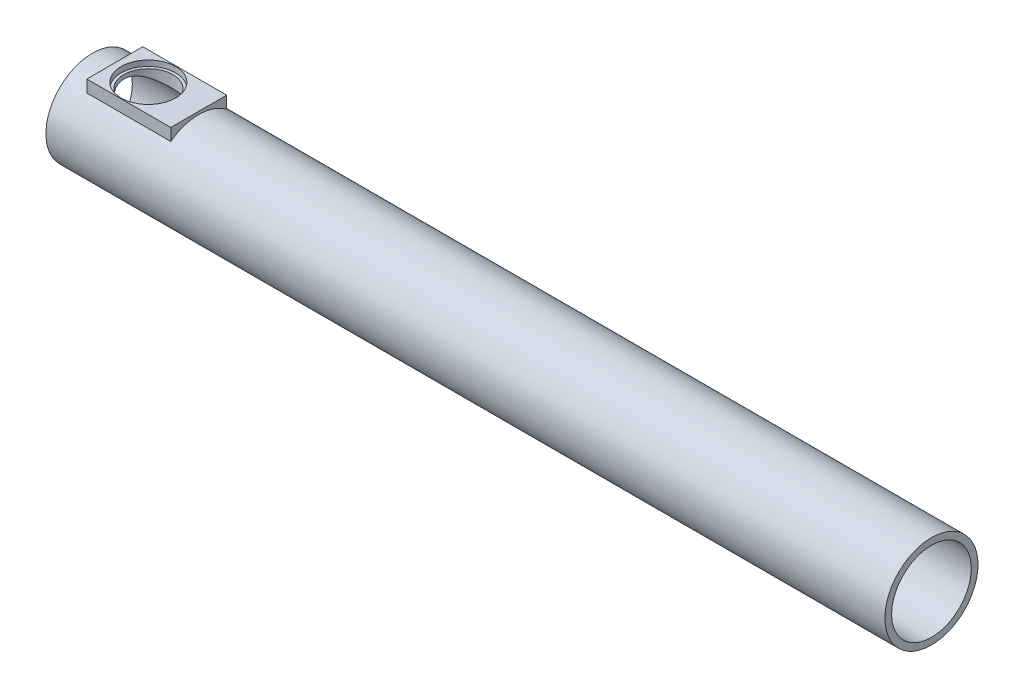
ISO-10303-21;
HEADER;
FILE_DESCRIPTION(('STEP AP214'),'2;1');
FILE_NAME('part.step','',(''),(''),'','','');
FILE_SCHEMA(('AUTOMOTIVE_DESIGN { 1 0 10303 214 1 1 1 1 }'));
ENDSEC;
DATA;
#1=APPLICATION_CONTEXT('core data for automotive mechanical design processes');
#2=APPLICATION_PROTOCOL_DEFINITION('international standard','automotive_design',2000,#1);
#3=PRODUCT_CONTEXT('',#1,'mechanical');
#4=PRODUCT('Part','Part','',(#3));
#5=PRODUCT_RELATED_PRODUCT_CATEGORY('part','',(#4));
#6=PRODUCT_DEFINITION_FORMATION('','',#4);
#7=PRODUCT_DEFINITION_CONTEXT('part definition',#1,'design');
#8=PRODUCT_DEFINITION('design','',#6,#7);
#9=PRODUCT_DEFINITION_SHAPE('','',#8);
#10=(LENGTH_UNIT() NAMED_UNIT(*) SI_UNIT(.MILLI.,.METRE.));
#11=(NAMED_UNIT(*) PLANE_ANGLE_UNIT() SI_UNIT($,.RADIAN.));
#12=(NAMED_UNIT(*) SI_UNIT($,.STERADIAN.) SOLID_ANGLE_UNIT());
#13=UNCERTAINTY_MEASURE_WITH_UNIT(LENGTH_MEASURE(1.E-05),#10,'distance_accuracy_value','');
#14=(GEOMETRIC_REPRESENTATION_CONTEXT(3) GLOBAL_UNCERTAINTY_ASSIGNED_CONTEXT((#13)) GLOBAL_UNIT_ASSIGNED_CONTEXT((#10,
#11,#12)) REPRESENTATION_CONTEXT('',''));
#15=CARTESIAN_POINT('',(0.,0.,0.));
#16=DIRECTION('',(0.,0.,1.));
#17=DIRECTION('',(1.,0.,0.));
#18=AXIS2_PLACEMENT_3D('',#15,#16,#17);
#19=CARTESIAN_POINT('',(1500.,0.,0.));
#20=DIRECTION('',(-1.,0.,0.));
#21=DIRECTION('',(0.,0.,1.));
#22=AXIS2_PLACEMENT_3D('',#19,#20,#21);
#23=CYLINDRICAL_SURFACE('',#22,83.185);
#24=CARTESIAN_POINT('',(0.,0.,0.));
#25=DIRECTION('',(1.,0.,0.));
#26=DIRECTION('',(0.,0.,-1.));
#27=AXIS2_PLACEMENT_3D('',#24,#25,#26);
#28=CIRCLE('',#27,83.185);
#29=CARTESIAN_POINT('',(0.,0.,-83.185));
#30=VERTEX_POINT('',#29);
#31=EDGE_CURVE('E38',#30,#30,#28,.T.);
#32=ORIENTED_EDGE('',*,*,#31,.T.);
#33=EDGE_LOOP('',(#32));
#34=FACE_BOUND('',#33,.T.);
#35=CARTESIAN_POINT('',(1500.,0.,0.));
#36=DIRECTION('',(1.,0.,0.));
#37=DIRECTION('',(0.,0.,-1.));
#38=AXIS2_PLACEMENT_3D('',#35,#36,#37);
#39=CIRCLE('',#38,83.185);
#40=CARTESIAN_POINT('',(1500.,0.,-83.185));
#41=VERTEX_POINT('',#40);
#42=EDGE_CURVE('E11',#41,#41,#39,.T.);
#43=ORIENTED_EDGE('',*,*,#42,.F.);
#44=EDGE_LOOP('',(#43));
#45=FACE_BOUND('',#44,.T.);
#46=CARTESIAN_POINT('',(40.,0.,0.));
#47=DIRECTION('',(-1.,0.,0.));
#48=DIRECTION('',(0.,0.,1.));
#49=AXIS2_PLACEMENT_3D('',#46,#47,#48);
#50=CIRCLE('',#49,83.185);
#51=CARTESIAN_POINT('',(40.,66.4811569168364,-50.));
#52=VERTEX_POINT('',#51);
#53=CARTESIAN_POINT('',(40.,66.4811569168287,50.));
#54=VERTEX_POINT('',#53);
#55=EDGE_CURVE('E72',#52,#54,#50,.F.);
#56=ORIENTED_EDGE('',*,*,#55,.F.);
#57=DIRECTION('',(-1.,0.,0.));
#58=VECTOR('',#57,1.);
#59=CARTESIAN_POINT('',(1500.,66.4811569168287,-50.));
#60=LINE('',#59,#58);
#61=CARTESIAN_POINT('',(190.,66.4811569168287,-50.));
#62=VERTEX_POINT('',#61);
#63=EDGE_CURVE('E75',#62,#52,#60,.T.);
#64=ORIENTED_EDGE('',*,*,#63,.F.);
#65=CARTESIAN_POINT('',(190.,0.,0.));
#66=DIRECTION('',(1.,0.,0.));
#67=DIRECTION('',(0.,0.,-1.));
#68=AXIS2_PLACEMENT_3D('',#65,#66,#67);
#69=CIRCLE('',#68,83.185);
#70=CARTESIAN_POINT('',(190.,66.4811569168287,50.));
#71=VERTEX_POINT('',#70);
#72=EDGE_CURVE('E54',#71,#62,#69,.F.);
#73=ORIENTED_EDGE('',*,*,#72,.F.);
#74=DIRECTION('',(-1.,0.,0.));
#75=VECTOR('',#74,1.);
#76=CARTESIAN_POINT('',(1500.,66.4811569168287,50.));
#77=LINE('',#76,#75);
#78=EDGE_CURVE('E49',#54,#71,#77,.F.);
#79=ORIENTED_EDGE('',*,*,#78,.F.);
#80=EDGE_LOOP('',(#56,#64,#73,#79));
#81=FACE_BOUND('',#80,.T.);
#82=ADVANCED_FACE('F35',(#34,#45,#81),#23,.T.);
#83=CARTESIAN_POINT('',(1500.,0.,0.));
#84=DIRECTION('',(1.,0.,0.));
#85=DIRECTION('',(0.,0.,-1.));
#86=AXIS2_PLACEMENT_3D('',#83,#84,#85);
#87=PLANE('',#86);
#88=ORIENTED_EDGE('',*,*,#42,.T.);
#89=EDGE_LOOP('',(#88));
#90=FACE_BOUND('',#89,.T.);
#91=CARTESIAN_POINT('',(1500.,0.,0.));
#92=DIRECTION('',(1.,0.,0.));
#93=DIRECTION('',(0.,0.,-1.));
#94=AXIS2_PLACEMENT_3D('',#91,#92,#93);
#95=CIRCLE('',#94,71.25);
#96=CARTESIAN_POINT('',(1500.,0.,-71.25));
#97=VERTEX_POINT('',#96);
#98=EDGE_CURVE('E114',#97,#97,#95,.T.);
#99=ORIENTED_EDGE('',*,*,#98,.F.);
#100=EDGE_LOOP('',(#99));
#101=FACE_BOUND('',#100,.T.);
#102=ADVANCED_FACE('F132',(#90,#101),#87,.T.);
#103=CARTESIAN_POINT('',(0.,0.,0.));
#104=DIRECTION('',(1.,0.,0.));
#105=DIRECTION('',(0.,0.,-1.));
#106=AXIS2_PLACEMENT_3D('',#103,#104,#105);
#107=PLANE('',#106);
#108=ORIENTED_EDGE('',*,*,#31,.F.);
#109=EDGE_LOOP('',(#108));
#110=FACE_BOUND('',#109,.T.);
#111=CARTESIAN_POINT('',(0.,0.,0.));
#112=DIRECTION('',(1.,0.,0.));
#113=DIRECTION('',(0.,0.,-1.));
#114=AXIS2_PLACEMENT_3D('',#111,#112,#113);
#115=CIRCLE('',#114,71.25);
#116=CARTESIAN_POINT('',(0.,0.,-71.25));
#117=VERTEX_POINT('',#116);
#118=EDGE_CURVE('E113',#117,#117,#115,.T.);
#119=ORIENTED_EDGE('',*,*,#118,.T.);
#120=EDGE_LOOP('',(#119));
#121=FACE_BOUND('',#120,.T.);
#122=ADVANCED_FACE('F120',(#110,#121),#107,.F.);
#123=CARTESIAN_POINT('',(1500.,0.,0.));
#124=DIRECTION('',(-1.,0.,0.));
#125=DIRECTION('',(0.,0.,1.));
#126=AXIS2_PLACEMENT_3D('',#123,#124,#125);
#127=CYLINDRICAL_SURFACE('',#126,71.25);
#128=CARTESIAN_POINT('',(100.,56.2361093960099,43.75));
#129=CARTESIAN_POINT('',(100.546387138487,56.236108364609,43.7500007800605));
#130=CARTESIAN_POINT('',(101.092764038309,56.2440798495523,43.7397605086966));
#131=CARTESIAN_POINT('',(102.184348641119,56.2758715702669,43.6988495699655));
#132=CARTESIAN_POINT('',(102.729556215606,56.2996934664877,43.6681767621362));
#133=CARTESIAN_POINT('',(103.817838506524,56.3629373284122,43.5865172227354));
#134=CARTESIAN_POINT('',(104.360911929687,56.4023676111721,43.5355196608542));
#135=CARTESIAN_POINT('',(105.443499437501,56.4963767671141,43.4134511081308));
#136=CARTESIAN_POINT('',(105.983013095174,56.5509574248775,43.3423777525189));
#137=CARTESIAN_POINT('',(107.597122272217,56.7368816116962,43.0990867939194));
#138=CARTESIAN_POINT('',(108.664892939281,56.8902643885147,42.896979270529));
#139=CARTESIAN_POINT('',(110.773672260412,57.2493773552,42.4165142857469));
#140=CARTESIAN_POINT('',(111.814684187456,57.4551011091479,42.1381661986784));
#141=CARTESIAN_POINT('',(113.855714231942,57.9094050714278,41.5115841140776));
#142=CARTESIAN_POINT('',(114.856004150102,58.1576089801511,41.1639596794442));
#143=CARTESIAN_POINT('',(116.820409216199,58.6901345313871,40.40107471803));
#144=CARTESIAN_POINT('',(117.784523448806,58.9744570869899,39.9858124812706));
#145=CARTESIAN_POINT('',(119.673140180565,59.5712158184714,39.0911970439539));
#146=CARTESIAN_POINT('',(120.597651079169,59.8836459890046,38.6118575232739));
#147=CARTESIAN_POINT('',(122.40481551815,60.5290283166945,37.5920653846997));
#148=CARTESIAN_POINT('',(123.287466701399,60.8619816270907,37.051609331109));
#149=CARTESIAN_POINT('',(125.11984742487,61.5849767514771,35.838716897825));
#150=CARTESIAN_POINT('',(126.063548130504,61.9768434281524,35.1582484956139));
#151=CARTESIAN_POINT('',(127.892041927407,62.7677183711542,33.7260334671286));
#152=CARTESIAN_POINT('',(128.776831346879,63.1667270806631,32.974282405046));
#153=CARTESIAN_POINT('',(130.485104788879,63.9630376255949,31.4017451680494));
#154=CARTESIAN_POINT('',(131.308539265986,64.3603378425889,30.5809043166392));
#155=CARTESIAN_POINT('',(132.88981827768,65.1442146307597,28.8734553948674));
#156=CARTESIAN_POINT('',(133.647659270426,65.5307906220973,27.9868437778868));
#157=CARTESIAN_POINT('',(135.176998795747,66.3283329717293,26.0449477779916));
#158=CARTESIAN_POINT('',(135.94001632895,66.7369800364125,24.981997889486));
#159=CARTESIAN_POINT('',(137.372897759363,67.5194290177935,22.7827027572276));
#160=CARTESIAN_POINT('',(138.042752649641,67.8932275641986,21.6463504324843));
#161=CARTESIAN_POINT('',(139.281511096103,68.5950201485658,19.3073824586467));
#162=CARTESIAN_POINT('',(139.850488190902,68.9230475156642,18.1048159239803));
#163=CARTESIAN_POINT('',(140.880350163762,69.5235785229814,15.6410243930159));
#164=CARTESIAN_POINT('',(141.341253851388,69.7960918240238,14.3798096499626));
#165=CARTESIAN_POINT('',(142.107797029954,70.2529819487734,11.9360373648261));
#166=CARTESIAN_POINT('',(142.424283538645,70.4434097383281,10.7580357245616));
#167=CARTESIAN_POINT('',(142.825161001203,70.685807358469,8.96896036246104));
#168=CARTESIAN_POINT('',(142.946490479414,70.7594068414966,8.36883346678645));
#169=CARTESIAN_POINT('',(143.164074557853,70.8916764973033,7.16244429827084));
#170=CARTESIAN_POINT('',(143.260332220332,70.9503484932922,6.55618278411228));
#171=CARTESIAN_POINT('',(143.427309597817,71.0522826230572,5.33931031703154));
#172=CARTESIAN_POINT('',(143.498047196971,71.0955555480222,4.72870271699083));
#173=CARTESIAN_POINT('',(143.61377159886,71.1664174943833,3.50422058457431));
#174=CARTESIAN_POINT('',(143.658761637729,71.1940084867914,2.89034647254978));
#175=CARTESIAN_POINT('',(143.722801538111,71.2332978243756,1.6607431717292));
#176=CARTESIAN_POINT('',(143.741852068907,71.2449965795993,1.04501403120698));
#177=CARTESIAN_POINT('',(143.75393843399,71.2524186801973,-0.186734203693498));
#178=CARTESIAN_POINT('',(143.746975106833,71.2481425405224,-0.802753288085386));
#179=CARTESIAN_POINT('',(143.692262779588,71.2145537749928,-2.48913380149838));
#180=CARTESIAN_POINT('',(143.618152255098,71.1690599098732,-3.55847785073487));
#181=CARTESIAN_POINT('',(143.392179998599,71.030792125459,-5.68555162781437));
#182=CARTESIAN_POINT('',(143.240326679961,70.9380233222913,-6.74328259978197));
#183=CARTESIAN_POINT('',(142.860826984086,70.7073389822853,-8.84008474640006));
#184=CARTESIAN_POINT('',(142.633177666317,70.5694216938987,-9.87915519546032));
#185=CARTESIAN_POINT('',(142.104808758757,70.2514799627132,-11.9319350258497));
#186=CARTESIAN_POINT('',(141.804086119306,70.0714537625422,-12.9456433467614));
#187=CARTESIAN_POINT('',(141.13153194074,69.6723000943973,-14.9458118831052));
#188=CARTESIAN_POINT('',(140.759424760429,69.4530212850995,-15.932148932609));
#189=CARTESIAN_POINT('',(139.948508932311,68.9802498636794,-17.8684344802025));
#190=CARTESIAN_POINT('',(139.509701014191,68.7267576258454,-18.8183833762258));
#191=CARTESIAN_POINT('',(138.569032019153,68.1903287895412,-20.6779638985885));
#192=CARTESIAN_POINT('',(138.067163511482,67.9073887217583,-21.5875907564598));
#193=CARTESIAN_POINT('',(137.004007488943,67.3171679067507,-23.3631521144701));
#194=CARTESIAN_POINT('',(136.442716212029,67.0098856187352,-24.2290838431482));
#195=CARTESIAN_POINT('',(135.191956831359,66.337490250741,-26.0177015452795));
#196=CARTESIAN_POINT('',(134.495208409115,65.9699011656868,-26.9343712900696));
#197=CARTESIAN_POINT('',(133.035394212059,65.2184454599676,-28.7061509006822));
#198=CARTESIAN_POINT('',(132.272323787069,64.8345776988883,-29.5612564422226));
#199=CARTESIAN_POINT('',(130.68255316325,64.0580773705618,-31.2082545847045));
#200=CARTESIAN_POINT('',(129.855769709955,63.6654338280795,-32.0000616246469));
#201=CARTESIAN_POINT('',(128.142693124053,62.8802958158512,-33.5165645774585));
#202=CARTESIAN_POINT('',(127.256397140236,62.4878013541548,-34.2412572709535));
#203=CARTESIAN_POINT('',(125.313412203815,61.6636151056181,-35.7064761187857));
#204=CARTESIAN_POINT('',(124.249235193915,61.2331130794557,-36.4377798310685));
#205=CARTESIAN_POINT('',(122.05299388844,60.3970493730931,-37.8074461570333));
#206=CARTESIAN_POINT('',(120.920917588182,59.9914921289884,-38.4457922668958));
#207=CARTESIAN_POINT('',(118.595226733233,59.220611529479,-39.6229232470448));
#208=CARTESIAN_POINT('',(117.401707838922,58.8552282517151,-40.1618572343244));
#209=CARTESIAN_POINT('',(114.957734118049,58.1795250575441,-41.1346157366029));
#210=CARTESIAN_POINT('',(113.707303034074,57.8691824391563,-41.5684836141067));
#211=CARTESIAN_POINT('',(111.48516590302,57.3894789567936,-42.2271334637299));
#212=CARTESIAN_POINT('',(110.524230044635,57.2043741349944,-42.4770010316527));
#213=CARTESIAN_POINT('',(108.580363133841,56.8788651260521,-42.9119005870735));
#214=CARTESIAN_POINT('',(107.597435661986,56.7384537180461,-43.0969430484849));
#215=CARTESIAN_POINT('',(105.616525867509,56.5073355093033,-43.3995379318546));
#216=CARTESIAN_POINT('',(104.6185611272,56.4165746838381,-43.5171637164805));
#217=CARTESIAN_POINT('',(102.613445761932,56.2879146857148,-43.6834559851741));
#218=CARTESIAN_POINT('',(101.606294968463,56.2500164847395,-43.7321212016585));
#219=CARTESIAN_POINT('',(99.5885671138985,56.2285489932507,-43.7597201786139));
#220=CARTESIAN_POINT('',(98.5779871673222,56.2450813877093,-43.7385234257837));
#221=CARTESIAN_POINT('',(96.5630588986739,56.3320452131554,-43.6264613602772));
#222=CARTESIAN_POINT('',(95.5587106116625,56.4024769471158,-43.535595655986));
#223=CARTESIAN_POINT('',(93.5628694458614,56.5946027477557,-43.2855422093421));
#224=CARTESIAN_POINT('',(92.5713860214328,56.7163325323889,-43.1263068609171));
#225=CARTESIAN_POINT('',(90.6083609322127,57.006668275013,-42.7417843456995));
#226=CARTESIAN_POINT('',(89.6368197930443,57.1752754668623,-42.5164954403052));
#227=CARTESIAN_POINT('',(87.728145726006,57.5519868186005,-42.0051307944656));
#228=CARTESIAN_POINT('',(86.7907722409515,57.7596968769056,-41.7196584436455));
#229=CARTESIAN_POINT('',(84.9447398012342,58.2096149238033,-41.0895724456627));
#230=CARTESIAN_POINT('',(84.0360803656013,58.4518223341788,-40.7449597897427));
#231=CARTESIAN_POINT('',(82.2502916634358,58.9645679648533,-39.9993359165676));
#232=CARTESIAN_POINT('',(81.3731690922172,59.2351121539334,-39.5983128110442));
#233=CARTESIAN_POINT('',(79.6529311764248,59.7983489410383,-38.7425139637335));
#234=CARTESIAN_POINT('',(78.8098185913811,60.0910433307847,-38.2877338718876));
#235=CARTESIAN_POINT('',(77.0056786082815,60.7487255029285,-37.2371717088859));
#236=CARTESIAN_POINT('',(76.0519484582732,61.1170223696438,-36.6309056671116));
#237=CARTESIAN_POINT('',(74.197682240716,61.8671198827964,-35.3493051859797));
#238=CARTESIAN_POINT('',(73.2971510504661,62.2489217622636,-34.6739644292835));
#239=CARTESIAN_POINT('',(71.5511338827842,63.0176407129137,-33.2564288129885));
#240=CARTESIAN_POINT('',(70.7056989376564,63.4045621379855,-32.5141734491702));
#241=CARTESIAN_POINT('',(69.0736233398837,64.1749425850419,-30.9659019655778));
#242=CARTESIAN_POINT('',(68.2869861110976,64.5584014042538,-30.1598821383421));
#243=CARTESIAN_POINT('',(66.664777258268,65.3695163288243,-28.3636537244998));
#244=CARTESIAN_POINT('',(65.8389761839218,65.7953962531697,-27.3637766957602));
#245=CARTESIAN_POINT('',(64.2747364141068,66.6209666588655,-25.2874990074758));
#246=CARTESIAN_POINT('',(63.5363074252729,67.0206542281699,-24.2110898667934));
#247=CARTESIAN_POINT('',(62.1537933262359,67.7827623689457,-21.9872745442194));
#248=CARTESIAN_POINT('',(61.509671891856,68.1451972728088,-20.8398959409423));
#249=CARTESIAN_POINT('',(60.3228425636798,68.8225208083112,-18.4805084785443));
#250=CARTESIAN_POINT('',(59.7801213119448,69.1374157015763,-17.2685081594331));
#251=CARTESIAN_POINT('',(58.8357522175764,69.6911669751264,-14.8699707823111));
#252=CARTESIAN_POINT('',(58.4271575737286,69.93367023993,-13.6870327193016));
#253=CARTESIAN_POINT('',(57.889962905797,70.2547856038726,-11.8828329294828));
#254=CARTESIAN_POINT('',(57.7234928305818,70.354730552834,-11.2763641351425));
#255=CARTESIAN_POINT('',(57.4164103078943,70.5396839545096,-10.0546921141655));
#256=CARTESIAN_POINT('',(57.2757945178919,70.6246943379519,-9.43949002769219));
#257=CARTESIAN_POINT('',(57.0211225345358,70.7790482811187,-8.20226650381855));
#258=CARTESIAN_POINT('',(56.907042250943,70.848406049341,-7.58025179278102));
#259=CARTESIAN_POINT('',(56.7057823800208,70.9710004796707,-6.3303891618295));
#260=CARTESIAN_POINT('',(56.6185992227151,71.0242392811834,-5.70254202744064));
#261=CARTESIAN_POINT('',(56.4715158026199,71.1141725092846,-4.44250078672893));
#262=CARTESIAN_POINT('',(56.4116140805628,71.1508678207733,-3.81030691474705));
#263=CARTESIAN_POINT('',(56.3193617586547,71.2074216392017,-2.54322926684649));
#264=CARTESIAN_POINT('',(56.2870100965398,71.2272807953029,-1.9083455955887));
#265=CARTESIAN_POINT('',(56.2367834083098,71.2581087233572,-0.182089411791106));
#266=CARTESIAN_POINT('',(56.2458750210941,71.2525211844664,0.910532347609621));
#267=CARTESIAN_POINT('',(56.3456423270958,71.1913022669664,3.09036260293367));
#268=CARTESIAN_POINT('',(56.436308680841,71.1356766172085,4.17757170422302));
#269=CARTESIAN_POINT('',(56.6979359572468,70.9757566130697,6.33863224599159));
#270=CARTESIAN_POINT('',(56.8688947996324,70.8714635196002,7.4124840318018));
#271=CARTESIAN_POINT('',(57.2888643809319,70.6166642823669,9.53920293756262));
#272=CARTESIAN_POINT('',(57.5378770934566,70.4661569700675,10.5920695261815));
#273=CARTESIAN_POINT('',(58.1033787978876,70.1268644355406,12.6426692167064));
#274=CARTESIAN_POINT('',(58.4179250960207,69.9391876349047,13.6411240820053));
#275=CARTESIAN_POINT('',(59.1148347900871,69.5271010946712,15.6061716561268));
#276=CARTESIAN_POINT('',(59.4971960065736,69.3026925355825,16.572765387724));
#277=CARTESIAN_POINT('',(60.3262444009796,68.8214570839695,18.4696273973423));
#278=CARTESIAN_POINT('',(60.7729363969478,68.5646277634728,19.3998929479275));
#279=CARTESIAN_POINT('',(61.7270725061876,68.0232509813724,21.2203160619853));
#280=CARTESIAN_POINT('',(62.2345204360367,67.7387017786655,22.1104711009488));
#281=CARTESIAN_POINT('',(63.3637370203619,67.1153564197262,23.9399629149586));
#282=CARTESIAN_POINT('',(63.9919238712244,66.7740090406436,24.8744712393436));
#283=CARTESIAN_POINT('',(65.3141353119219,66.0703859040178,26.6873046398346));
#284=CARTESIAN_POINT('',(66.0081638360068,65.7081088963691,27.5656263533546));
#285=CARTESIAN_POINT('',(67.4589747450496,64.9694394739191,29.2641928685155));
#286=CARTESIAN_POINT('',(68.2158220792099,64.5930326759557,30.0843758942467));
#287=CARTESIAN_POINT('',(69.7882963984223,63.8339478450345,31.6631801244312));
#288=CARTESIAN_POINT('',(70.603926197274,63.4512695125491,32.4217983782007));
#289=CARTESIAN_POINT('',(72.406809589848,62.6350720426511,33.9747156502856));
#290=CARTESIAN_POINT('',(73.4022612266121,62.2017763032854,34.7596449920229));
#291=CARTESIAN_POINT('',(75.4617678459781,61.3493771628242,36.2429076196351));
#292=CARTESIAN_POINT('',(76.5258350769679,60.9302763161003,36.9412253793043));
#293=CARTESIAN_POINT('',(78.7181648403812,60.1197114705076,38.2462101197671));
#294=CARTESIAN_POINT('',(79.8463985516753,59.7282352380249,38.8529178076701));
#295=CARTESIAN_POINT('',(82.162797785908,58.9869750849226,39.9693432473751));
#296=CARTESIAN_POINT('',(83.3509419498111,58.6371764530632,40.479095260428));
#297=CARTESIAN_POINT('',(85.510626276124,58.0655829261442,41.2933414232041));
#298=CARTESIAN_POINT('',(86.4715449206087,57.8326240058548,41.6182698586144));
#299=CARTESIAN_POINT('',(88.4221653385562,57.4076718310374,42.2025164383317));
#300=CARTESIAN_POINT('',(89.4118674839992,57.215679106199,42.4618337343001));
#301=CARTESIAN_POINT('',(91.4118846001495,56.8795814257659,42.9110045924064));
#302=CARTESIAN_POINT('',(92.4221323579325,56.7353407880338,43.101055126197));
#303=CARTESIAN_POINT('',(94.4591553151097,56.4993739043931,43.4099232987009));
#304=CARTESIAN_POINT('',(95.4859208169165,56.4076179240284,43.528781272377));
#305=CARTESIAN_POINT('',(97.0956027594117,56.3080915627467,43.6573508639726));
#306=CARTESIAN_POINT('',(97.6754996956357,56.2811348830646,43.6920711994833));
#307=CARTESIAN_POINT('',(98.8369347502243,56.2451425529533,43.7383976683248));
#308=CARTESIAN_POINT('',(99.4184731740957,56.2361104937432,43.7499991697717));
#309=CARTESIAN_POINT('',(100.,56.2361093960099,43.75));
#310=B_SPLINE_CURVE_WITH_KNOTS('',3,(#128,#129,#130,#131,#132,#133,#134,#135,#136,#137,#138,
#139,#140,#141,#142,#143,#144,#145,#146,#147,#148,#149,#150,#151,#152,#153,#154,#155,#156,#157,
#158,#159,#160,#161,#162,#163,#164,#165,#166,#167,#168,#169,#170,#171,#172,#173,#174,#175,#176,
#177,#178,#179,#180,#181,#182,#183,#184,#185,#186,#187,#188,#189,#190,#191,#192,#193,#194,#195,
#196,#197,#198,#199,#200,#201,#202,#203,#204,#205,#206,#207,#208,#209,#210,#211,#212,#213,#214,
#215,#216,#217,#218,#219,#220,#221,#222,#223,#224,#225,#226,#227,#228,#229,#230,#231,#232,#233,
#234,#235,#236,#237,#238,#239,#240,#241,#242,#243,#244,#245,#246,#247,#248,#249,#250,#251,#252,
#253,#254,#255,#256,#257,#258,#259,#260,#261,#262,#263,#264,#265,#266,#267,#268,#269,#270,#271,
#272,#273,#274,#275,#276,#277,#278,#279,#280,#281,#282,#283,#284,#285,#286,#287,#288,#289,#290,
#291,#292,#293,#294,#295,#296,#297,#298,#299,#300,#301,#302,#303,#304,#305,#306,#307,#308,#309),
.UNSPECIFIED.,.T.,.F.,(4,2,2,2,2,2,2,2,2,2,2,2,2,2,2,2,2,2,2,2,2,2,2,2,2,2,2,2,2,2,2,2,2,2,2,2,
2,2,2,2,2,2,2,2,2,2,2,2,2,2,2,2,2,2,2,2,2,2,2,2,2,2,2,2,2,2,2,2,2,2,2,2,2,2,2,2,2,2,2,2,2,2,2,2,
2,2,2,2,2,2,4),(0.,1.6389889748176,3.27814967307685,4.91818498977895,6.55841357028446,
9.84605560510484,13.1332935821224,16.3927917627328,19.6523723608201,22.911258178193,
26.1703272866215,29.8496893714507,33.5292805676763,37.2118116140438,40.8945413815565,
45.0014531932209,49.1087617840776,53.2130637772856,57.316650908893,61.0144198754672,
62.8638468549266,64.7130478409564,66.5609504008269,68.4086206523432,70.2562432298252,
72.103806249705,75.318156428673,78.5321588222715,81.7462859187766,84.96054717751,
88.1874791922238,91.4143759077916,94.6416532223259,97.8691349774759,101.491447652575,
105.114014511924,108.741398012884,112.368955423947,116.447278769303,120.526325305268,
124.599202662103,128.67039619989,131.697390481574,134.723895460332,137.74710071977,
140.770361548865,143.799273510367,146.828202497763,149.859243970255,152.890365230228,
155.892430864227,158.894446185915,161.897095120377,164.899987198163,168.462353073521,
172.025045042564,175.590991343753,179.157145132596,183.24684747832,187.337003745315,
191.425580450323,195.513618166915,199.331842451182,201.24159037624,203.1510912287,
205.058851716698,206.966358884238,208.873764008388,210.781095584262,214.054581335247,
217.327692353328,220.600718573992,223.873827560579,227.061023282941,230.248116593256,
233.435448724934,236.622981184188,240.149302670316,243.67583499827,247.206059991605,
250.736454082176,254.750910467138,258.766085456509,262.77947101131,266.791435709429,
269.910798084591,273.030200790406,276.140662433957,279.249360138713,280.993407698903,
282.737804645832),.UNSPECIFIED.);
#311=CARTESIAN_POINT('',(100.,56.2361093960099,43.75));
#312=VERTEX_POINT('',#311);
#313=EDGE_CURVE('E246',#312,#312,#310,.T.);
#314=ORIENTED_EDGE('',*,*,#313,.T.);
#315=EDGE_LOOP('',(#314));
#316=FACE_BOUND('',#315,.T.);
#317=ORIENTED_EDGE('',*,*,#98,.T.);
#318=EDGE_LOOP('',(#317));
#319=FACE_BOUND('',#318,.T.);
#320=ORIENTED_EDGE('',*,*,#118,.F.);
#321=EDGE_LOOP('',(#320));
#322=FACE_BOUND('',#321,.T.);
#323=ADVANCED_FACE('F122',(#316,#319,#322),#127,.F.);
#324=CARTESIAN_POINT('',(40.,88.185,-50.));
#325=DIRECTION('',(1.,0.,0.));
#326=DIRECTION('',(0.,0.,-1.));
#327=AXIS2_PLACEMENT_3D('',#324,#325,#326);
#328=PLANE('',#327);
#329=DIRECTION('',(0.,-1.,0.));
#330=VECTOR('',#329,1.);
#331=CARTESIAN_POINT('',(40.,88.185,-50.));
#332=LINE('',#331,#330);
#333=CARTESIAN_POINT('',(40.,88.185,-50.));
#334=VERTEX_POINT('',#333);
#335=EDGE_CURVE('E82',#334,#52,#332,.T.);
#336=ORIENTED_EDGE('',*,*,#335,.T.);
#337=ORIENTED_EDGE('',*,*,#55,.T.);
#338=DIRECTION('',(0.,-1.,0.));
#339=VECTOR('',#338,1.);
#340=CARTESIAN_POINT('',(40.,88.185,50.));
#341=LINE('',#340,#339);
#342=CARTESIAN_POINT('',(40.,88.185,50.));
#343=VERTEX_POINT('',#342);
#344=EDGE_CURVE('E111',#343,#54,#341,.T.);
#345=ORIENTED_EDGE('',*,*,#344,.F.);
#346=DIRECTION('',(0.,0.,1.));
#347=VECTOR('',#346,1.);
#348=CARTESIAN_POINT('',(40.,88.185,-50.));
#349=LINE('',#348,#347);
#350=EDGE_CURVE('E85',#334,#343,#349,.T.);
#351=ORIENTED_EDGE('',*,*,#350,.F.);
#352=EDGE_LOOP('',(#336,#337,#345,#351));
#353=FACE_BOUND('',#352,.T.);
#354=ADVANCED_FACE('F83',(#353),#328,.F.);
#355=CARTESIAN_POINT('',(40.,88.185,50.));
#356=DIRECTION('',(0.,0.,-1.));
#357=DIRECTION('',(-1.,0.,0.));
#358=AXIS2_PLACEMENT_3D('',#355,#356,#357);
#359=PLANE('',#358);
#360=ORIENTED_EDGE('',*,*,#344,.T.);
#361=ORIENTED_EDGE('',*,*,#78,.T.);
#362=DIRECTION('',(0.,-1.,0.));
#363=VECTOR('',#362,1.);
#364=CARTESIAN_POINT('',(190.,88.185,50.));
#365=LINE('',#364,#363);
#366=CARTESIAN_POINT('',(190.,88.185,50.));
#367=VERTEX_POINT('',#366);
#368=EDGE_CURVE('E109',#367,#71,#365,.T.);
#369=ORIENTED_EDGE('',*,*,#368,.F.);
#370=DIRECTION('',(1.,0.,0.));
#371=VECTOR('',#370,1.);
#372=CARTESIAN_POINT('',(40.,88.185,50.));
#373=LINE('',#372,#371);
#374=EDGE_CURVE('E103',#343,#367,#373,.T.);
#375=ORIENTED_EDGE('',*,*,#374,.F.);
#376=EDGE_LOOP('',(#360,#361,#369,#375));
#377=FACE_BOUND('',#376,.T.);
#378=ADVANCED_FACE('F130',(#377),#359,.F.);
#379=CARTESIAN_POINT('',(190.,88.185,-50.));
#380=DIRECTION('',(-1.,0.,0.));
#381=DIRECTION('',(0.,0.,1.));
#382=AXIS2_PLACEMENT_3D('',#379,#380,#381);
#383=PLANE('',#382);
#384=ORIENTED_EDGE('',*,*,#368,.T.);
#385=ORIENTED_EDGE('',*,*,#72,.T.);
#386=DIRECTION('',(0.,-1.,0.));
#387=VECTOR('',#386,1.);
#388=CARTESIAN_POINT('',(190.,88.185,-50.));
#389=LINE('',#388,#387);
#390=CARTESIAN_POINT('',(190.,88.185,-50.));
#391=VERTEX_POINT('',#390);
#392=EDGE_CURVE('E88',#391,#62,#389,.T.);
#393=ORIENTED_EDGE('',*,*,#392,.F.);
#394=DIRECTION('',(0.,0.,-1.));
#395=VECTOR('',#394,1.);
#396=CARTESIAN_POINT('',(190.,88.185,-50.));
#397=LINE('',#396,#395);
#398=EDGE_CURVE('E105',#367,#391,#397,.T.);
#399=ORIENTED_EDGE('',*,*,#398,.F.);
#400=EDGE_LOOP('',(#384,#385,#393,#399));
#401=FACE_BOUND('',#400,.T.);
#402=ADVANCED_FACE('F175',(#401),#383,.F.);
#403=CARTESIAN_POINT('',(40.,88.185,-50.));
#404=DIRECTION('',(0.,0.,1.));
#405=DIRECTION('',(1.,0.,0.));
#406=AXIS2_PLACEMENT_3D('',#403,#404,#405);
#407=PLANE('',#406);
#408=ORIENTED_EDGE('',*,*,#392,.T.);
#409=ORIENTED_EDGE('',*,*,#63,.T.);
#410=ORIENTED_EDGE('',*,*,#335,.F.);
#411=DIRECTION('',(-1.,0.,0.));
#412=VECTOR('',#411,1.);
#413=CARTESIAN_POINT('',(40.,88.185,-50.));
#414=LINE('',#413,#412);
#415=EDGE_CURVE('E89',#391,#334,#414,.T.);
#416=ORIENTED_EDGE('',*,*,#415,.F.);
#417=EDGE_LOOP('',(#408,#409,#410,#416));
#418=FACE_BOUND('',#417,.T.);
#419=ADVANCED_FACE('F91',(#418),#407,.F.);
#420=CARTESIAN_POINT('',(0.,88.185,0.));
#421=DIRECTION('',(0.,1.,0.));
#422=DIRECTION('',(0.,0.,1.));
#423=AXIS2_PLACEMENT_3D('',#420,#421,#422);
#424=PLANE('',#423);
#425=CARTESIAN_POINT('',(100.,88.185,0.));
#426=DIRECTION('',(0.,1.,0.));
#427=DIRECTION('',(0.,0.,1.));
#428=AXIS2_PLACEMENT_3D('',#425,#426,#427);
#429=CIRCLE('',#428,48.75);
#430=CARTESIAN_POINT('',(100.,88.185,48.75));
#431=VERTEX_POINT('',#430);
#432=EDGE_CURVE('E96',#431,#431,#429,.T.);
#433=ORIENTED_EDGE('',*,*,#432,.F.);
#434=EDGE_LOOP('',(#433));
#435=FACE_BOUND('',#434,.T.);
#436=ORIENTED_EDGE('',*,*,#350,.T.);
#437=ORIENTED_EDGE('',*,*,#374,.T.);
#438=ORIENTED_EDGE('',*,*,#398,.T.);
#439=ORIENTED_EDGE('',*,*,#415,.T.);
#440=EDGE_LOOP('',(#436,#437,#438,#439));
#441=FACE_BOUND('',#440,.T.);
#442=ADVANCED_FACE('F194',(#435,#441),#424,.T.);
#443=CARTESIAN_POINT('',(100.,78.185,0.));
#444=DIRECTION('',(0.,1.,0.));
#445=DIRECTION('',(0.,0.,1.));
#446=AXIS2_PLACEMENT_3D('',#443,#444,#445);
#447=CYLINDRICAL_SURFACE('',#446,48.75);
#448=CARTESIAN_POINT('',(100.,78.185,0.));
#449=DIRECTION('',(0.,1.,0.));
#450=DIRECTION('',(0.,0.,1.));
#451=AXIS2_PLACEMENT_3D('',#448,#449,#450);
#452=CIRCLE('',#451,48.75);
#453=CARTESIAN_POINT('',(100.,78.185,48.75));
#454=VERTEX_POINT('',#453);
#455=EDGE_CURVE('E93',#454,#454,#452,.T.);
#456=ORIENTED_EDGE('',*,*,#455,.F.);
#457=EDGE_LOOP('',(#456));
#458=FACE_BOUND('',#457,.T.);
#459=ORIENTED_EDGE('',*,*,#432,.T.);
#460=EDGE_LOOP('',(#459));
#461=FACE_BOUND('',#460,.T.);
#462=ADVANCED_FACE('F203',(#458,#461),#447,.F.);
#463=CARTESIAN_POINT('',(100.,78.185,0.));
#464=DIRECTION('',(0.,1.,0.));
#465=DIRECTION('',(0.,0.,1.));
#466=AXIS2_PLACEMENT_3D('',#463,#464,#465);
#467=PLANE('',#466);
#468=CARTESIAN_POINT('',(100.,78.185,0.));
#469=DIRECTION('',(0.,1.,0.));
#470=DIRECTION('',(0.,0.,1.));
#471=AXIS2_PLACEMENT_3D('',#468,#469,#470);
#472=CIRCLE('',#471,43.75);
#473=CARTESIAN_POINT('',(100.,78.185,43.75));
#474=VERTEX_POINT('',#473);
#475=EDGE_CURVE('E250',#474,#474,#472,.T.);
#476=ORIENTED_EDGE('',*,*,#475,.F.);
#477=EDGE_LOOP('',(#476));
#478=FACE_BOUND('',#477,.T.);
#479=ORIENTED_EDGE('',*,*,#455,.T.);
#480=EDGE_LOOP('',(#479));
#481=FACE_BOUND('',#480,.T.);
#482=ADVANCED_FACE('F212',(#478,#481),#467,.T.);
#483=CARTESIAN_POINT('',(100.,-83.186,0.));
#484=DIRECTION('',(0.,1.,0.));
#485=DIRECTION('',(0.,0.,1.));
#486=AXIS2_PLACEMENT_3D('',#483,#484,#485);
#487=CYLINDRICAL_SURFACE('',#486,43.75);
#488=ORIENTED_EDGE('',*,*,#475,.T.);
#489=EDGE_LOOP('',(#488));
#490=FACE_BOUND('',#489,.T.);
#491=ORIENTED_EDGE('',*,*,#313,.F.);
#492=EDGE_LOOP('',(#491));
#493=FACE_BOUND('',#492,.T.);
#494=ADVANCED_FACE('F226',(#490,#493),#487,.F.);
#495=CLOSED_SHELL('',(#82,#102,#122,#323,#354,#378,#402,#419,#442,#462,#482,#494));
#496=MANIFOLD_SOLID_BREP('B2',#495);
#497=ADVANCED_BREP_SHAPE_REPRESENTATION('',(#18,#496),#14);
#498=SHAPE_DEFINITION_REPRESENTATION(#9,#497);
ENDSEC;
END-ISO-10303-21;
